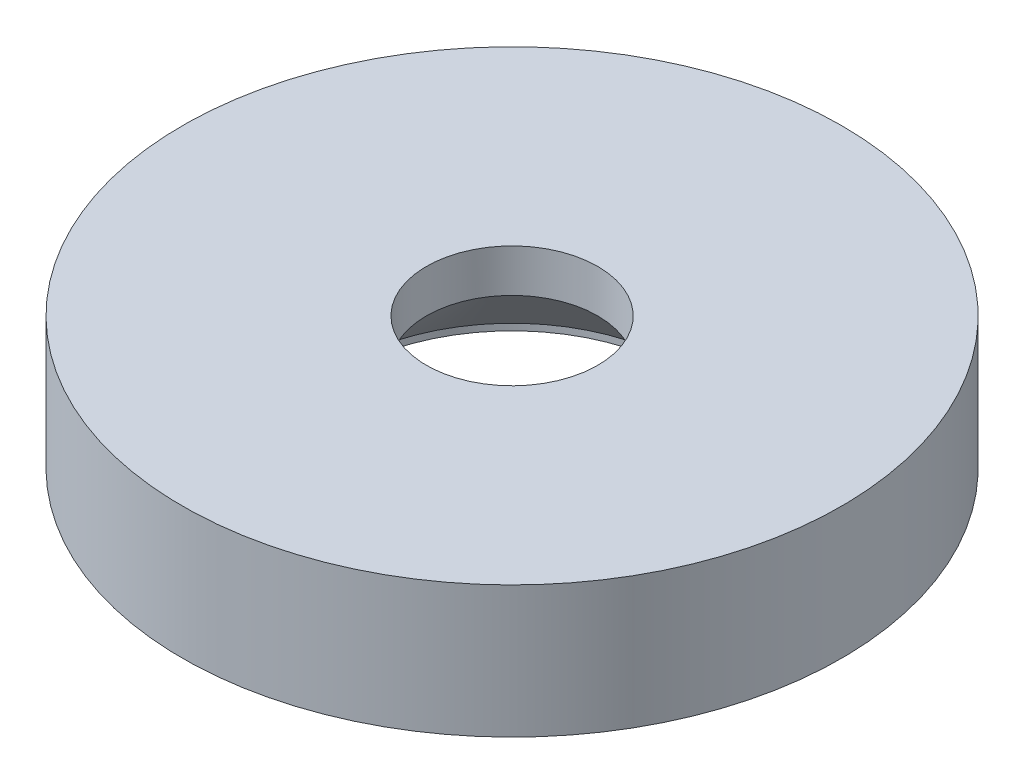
ISO-10303-21;
HEADER;
FILE_DESCRIPTION(('STEP AP214'),'2;1');
FILE_NAME('part.step','',(''),(''),'','','');
FILE_SCHEMA(('AUTOMOTIVE_DESIGN { 1 0 10303 214 1 1 1 1 }'));
ENDSEC;
DATA;
#1=APPLICATION_CONTEXT('core data for automotive mechanical design processes');
#2=APPLICATION_PROTOCOL_DEFINITION('international standard','automotive_design',2000,#1);
#3=PRODUCT_CONTEXT('',#1,'mechanical');
#4=PRODUCT('Part','Part','',(#3));
#5=PRODUCT_RELATED_PRODUCT_CATEGORY('part','',(#4));
#6=PRODUCT_DEFINITION_FORMATION('','',#4);
#7=PRODUCT_DEFINITION_CONTEXT('part definition',#1,'design');
#8=PRODUCT_DEFINITION('design','',#6,#7);
#9=PRODUCT_DEFINITION_SHAPE('','',#8);
#10=(LENGTH_UNIT() NAMED_UNIT(*) SI_UNIT(.MILLI.,.METRE.));
#11=(NAMED_UNIT(*) PLANE_ANGLE_UNIT() SI_UNIT($,.RADIAN.));
#12=(NAMED_UNIT(*) SI_UNIT($,.STERADIAN.) SOLID_ANGLE_UNIT());
#13=UNCERTAINTY_MEASURE_WITH_UNIT(LENGTH_MEASURE(1.E-05),#10,'distance_accuracy_value','');
#14=(GEOMETRIC_REPRESENTATION_CONTEXT(3) GLOBAL_UNCERTAINTY_ASSIGNED_CONTEXT((#13)) GLOBAL_UNIT_ASSIGNED_CONTEXT((#10,
#11,#12)) REPRESENTATION_CONTEXT('',''));
#15=CARTESIAN_POINT('',(0.,0.,0.));
#16=DIRECTION('',(0.,0.,1.));
#17=DIRECTION('',(1.,0.,0.));
#18=AXIS2_PLACEMENT_3D('',#15,#16,#17);
#19=CARTESIAN_POINT('',(65.,-129.3,225.));
#20=DIRECTION('',(0.,-1.,0.));
#21=DIRECTION('',(0.,0.,-1.));
#22=AXIS2_PLACEMENT_3D('',#19,#20,#21);
#23=CONICAL_SURFACE('',#22,2.6,0.785398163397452);
#24=CARTESIAN_POINT('',(65.,-129.3,225.));
#25=DIRECTION('',(0.,-1.,0.));
#26=DIRECTION('',(-1.,0.,0.));
#27=AXIS2_PLACEMENT_3D('',#24,#25,#26);
#28=CIRCLE('',#27,2.6);
#29=CARTESIAN_POINT('',(62.4,-129.3,225.));
#30=VERTEX_POINT('',#29);
#31=EDGE_CURVE('E36',#30,#30,#28,.T.);
#32=ORIENTED_EDGE('',*,*,#31,.F.);
#33=EDGE_LOOP('',(#32));
#34=FACE_BOUND('',#33,.T.);
#35=CARTESIAN_POINT('',(65.,-131.8,225.));
#36=DIRECTION('',(0.,-1.,0.));
#37=DIRECTION('',(-1.,0.,0.));
#38=AXIS2_PLACEMENT_3D('',#35,#36,#37);
#39=CIRCLE('',#38,5.1);
#40=CARTESIAN_POINT('',(59.9,-131.8,225.));
#41=VERTEX_POINT('',#40);
#42=EDGE_CURVE('E30',#41,#41,#39,.F.);
#43=ORIENTED_EDGE('',*,*,#42,.F.);
#44=EDGE_LOOP('',(#43));
#45=FACE_BOUND('',#44,.T.);
#46=ADVANCED_FACE('F14',(#34,#45),#23,.F.);
#47=CARTESIAN_POINT('',(65.,-131.8,225.));
#48=DIRECTION('',(0.,-1.,0.));
#49=DIRECTION('',(0.,0.,-1.));
#50=AXIS2_PLACEMENT_3D('',#47,#48,#49);
#51=CYLINDRICAL_SURFACE('',#50,5.1);
#52=ORIENTED_EDGE('',*,*,#42,.T.);
#53=EDGE_LOOP('',(#52));
#54=FACE_BOUND('',#53,.T.);
#55=CARTESIAN_POINT('',(65.,-132.,225.));
#56=DIRECTION('',(0.,-1.,0.));
#57=DIRECTION('',(0.,0.,-1.));
#58=AXIS2_PLACEMENT_3D('',#55,#56,#57);
#59=CIRCLE('',#58,5.1);
#60=CARTESIAN_POINT('',(65.,-132.,219.9));
#61=VERTEX_POINT('',#60);
#62=EDGE_CURVE('E18',#61,#61,#59,.F.);
#63=ORIENTED_EDGE('',*,*,#62,.F.);
#64=EDGE_LOOP('',(#63));
#65=FACE_BOUND('',#64,.T.);
#66=ADVANCED_FACE('F45',(#54,#65),#51,.F.);
#67=CARTESIAN_POINT('',(65.,-128.,225.));
#68=DIRECTION('',(0.,-1.,0.));
#69=DIRECTION('',(0.,0.,-1.));
#70=AXIS2_PLACEMENT_3D('',#67,#68,#69);
#71=CYLINDRICAL_SURFACE('',#70,2.6);
#72=CARTESIAN_POINT('',(65.,-128.,225.));
#73=DIRECTION('',(0.,-1.,0.));
#74=DIRECTION('',(0.,0.,-1.));
#75=AXIS2_PLACEMENT_3D('',#72,#73,#74);
#76=CIRCLE('',#75,2.6);
#77=CARTESIAN_POINT('',(65.,-128.,222.4));
#78=VERTEX_POINT('',#77);
#79=EDGE_CURVE('E27',#78,#78,#76,.T.);
#80=ORIENTED_EDGE('',*,*,#79,.F.);
#81=EDGE_LOOP('',(#80));
#82=FACE_BOUND('',#81,.T.);
#83=ORIENTED_EDGE('',*,*,#31,.T.);
#84=EDGE_LOOP('',(#83));
#85=FACE_BOUND('',#84,.T.);
#86=ADVANCED_FACE('F55',(#82,#85),#71,.F.);
#87=CARTESIAN_POINT('',(75.12,-132.,235.12));
#88=DIRECTION('',(0.,-1.,0.));
#89=DIRECTION('',(-1.,0.,0.));
#90=AXIS2_PLACEMENT_3D('',#87,#88,#89);
#91=PLANE('',#90);
#92=ORIENTED_EDGE('',*,*,#62,.T.);
#93=EDGE_LOOP('',(#92));
#94=FACE_BOUND('',#93,.T.);
#95=CARTESIAN_POINT('',(65.,-132.,225.));
#96=DIRECTION('',(0.,-1.,0.));
#97=DIRECTION('',(0.,0.,-1.));
#98=AXIS2_PLACEMENT_3D('',#95,#96,#97);
#99=CIRCLE('',#98,10.);
#100=CARTESIAN_POINT('',(65.,-132.,215.));
#101=VERTEX_POINT('',#100);
#102=EDGE_CURVE('E22',#101,#101,#99,.T.);
#103=ORIENTED_EDGE('',*,*,#102,.T.);
#104=EDGE_LOOP('',(#103));
#105=FACE_BOUND('',#104,.T.);
#106=ADVANCED_FACE('F64',(#94,#105),#91,.T.);
#107=CARTESIAN_POINT('',(54.88,-128.,235.12));
#108=DIRECTION('',(0.,1.,0.));
#109=DIRECTION('',(1.,0.,0.));
#110=AXIS2_PLACEMENT_3D('',#107,#108,#109);
#111=PLANE('',#110);
#112=ORIENTED_EDGE('',*,*,#79,.T.);
#113=EDGE_LOOP('',(#112));
#114=FACE_BOUND('',#113,.T.);
#115=CARTESIAN_POINT('',(65.,-128.,225.));
#116=DIRECTION('',(0.,-1.,0.));
#117=DIRECTION('',(0.,0.,-1.));
#118=AXIS2_PLACEMENT_3D('',#115,#116,#117);
#119=CIRCLE('',#118,10.);
#120=CARTESIAN_POINT('',(65.,-128.,215.));
#121=VERTEX_POINT('',#120);
#122=EDGE_CURVE('E10',#121,#121,#119,.F.);
#123=ORIENTED_EDGE('',*,*,#122,.T.);
#124=EDGE_LOOP('',(#123));
#125=FACE_BOUND('',#124,.T.);
#126=ADVANCED_FACE('F16',(#114,#125),#111,.T.);
#127=CARTESIAN_POINT('',(65.,-128.,225.));
#128=DIRECTION('',(0.,-1.,0.));
#129=DIRECTION('',(0.,0.,-1.));
#130=AXIS2_PLACEMENT_3D('',#127,#128,#129);
#131=CYLINDRICAL_SURFACE('',#130,10.);
#132=ORIENTED_EDGE('',*,*,#102,.F.);
#133=EDGE_LOOP('',(#132));
#134=FACE_BOUND('',#133,.T.);
#135=ORIENTED_EDGE('',*,*,#122,.F.);
#136=EDGE_LOOP('',(#135));
#137=FACE_BOUND('',#136,.T.);
#138=ADVANCED_FACE('F57',(#134,#137),#131,.T.);
#139=CLOSED_SHELL('',(#46,#66,#86,#106,#126,#138));
#140=MANIFOLD_SOLID_BREP('B1',#139);
#141=ADVANCED_BREP_SHAPE_REPRESENTATION('',(#18,#140),#14);
#142=SHAPE_DEFINITION_REPRESENTATION(#9,#141);
ENDSEC;
END-ISO-10303-21;
